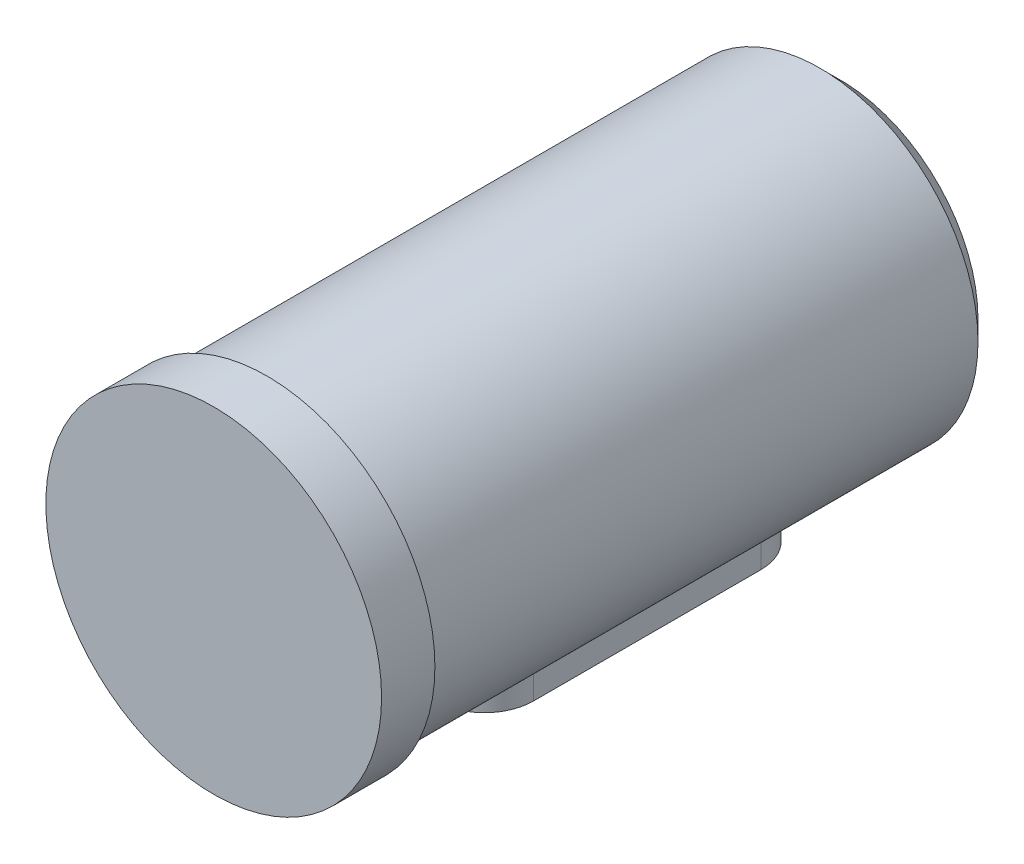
from build123d import *

# Parameters (mm, degrees)
CHANFREIN1_SIZE       = 1
EXTRUSION1_REACH      = 43.969
EXTRUSION1_END_RADIUS = 8


with BuildPart() as part:
    # Esquisse1 → R_volution1 (revolve)
    with BuildSketch(Plane(origin=(0, 0, 0), x_dir=(0, 0, -1), z_dir=(1, 0, 0)), mode=Mode.PRIVATE) as r_volution1_sk:
        Polygon((5, 8.5), (5, 0), (36.7, 0), (36.7, 8), (7.7, 8), (7.7, 8.5), align=None)
    revolve(r_volution1_sk.sketch.rotate(Axis((0, 0, 0), (0, 0, -1)), 90), axis=Axis((0, 0, 0), (0, 0, -1)))

    # Chanfrein1
    chanfrein1_edges = [part.edges().sort_by_distance(p)[0] for p in [
        (-8, 0, -36.7),
    ]]
    chamfer(chanfrein1_edges, length=CHANFREIN1_SIZE)

    # Esquisse3 → Trou taraud_ M6x1.01 (revolve, cut)
    with BuildSketch(Plane(origin=(0, 0, -36.7), x_dir=(0, 1, 0), z_dir=(1, 0, 0))):
        Polygon((0, 0), (0, 20.502151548), (2.5, 19), (2.5, 3.732050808), (3.5, 0), align=None)
    revolve(axis=Axis((0, 0, -43.05), (0, 0, 1)), mode=Mode.SUBTRACT)

    # Extrusion1: up to this cylinder (the profile starts outside it)
    extrusion1_end = Plane(origin=(0, 0, -24.45), z_dir=(0, 0, 1)) * Cylinder(EXTRUSION1_END_RADIUS, 104.938, mode=Mode.PRIVATE)
    # Esquisse4 → Extrusion1 (add, up to the surface)
    with BuildSketch(Plane(origin=(0, -10, 0), x_dir=(-1, 0, 0), z_dir=(0, 1, 0)), mode=Mode.PRIVATE) as extrusion1_sk1:
        with BuildLine():
            Line((-2.5, -18.7), (-2.5, -30.2))
            ThreePointArc((-2.5, -30.2), (0, -32.7), (2.5, -30.2))
            Line((2.5, -30.2), (2.5, -18.7))
            ThreePointArc((2.5, -18.7), (0, -16.2), (-2.5, -18.7))
        make_face()
    extrusion1_tool1 = extrude(extrusion1_sk1.sketch, amount=EXTRUSION1_REACH, mode=Mode.PRIVATE) - extrusion1_end
    add(extrusion1_tool1.solids().sort_by_distance((0, -10, -24.45))[0])


solid = part.part
